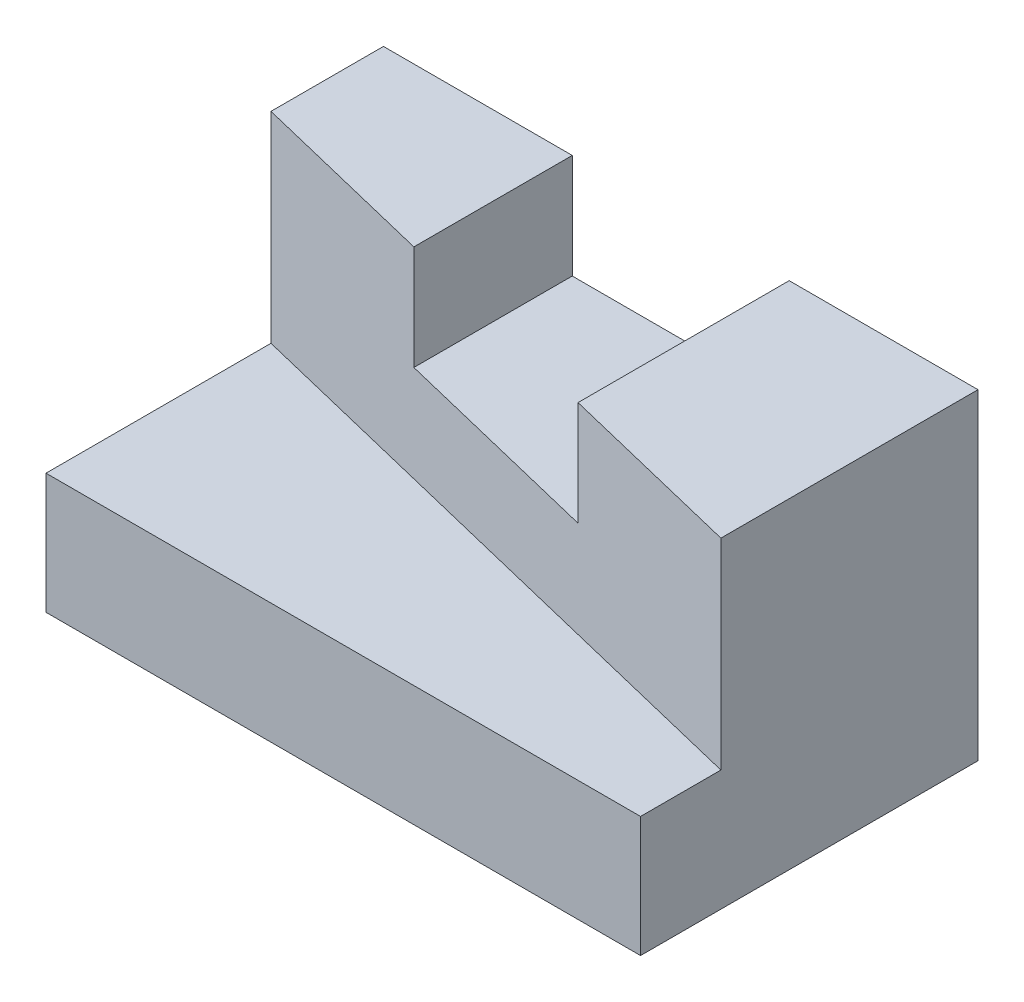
ISO-10303-21;
HEADER;
FILE_DESCRIPTION(('STEP AP214'),'2;1');
FILE_NAME('part.step','',(''),(''),'','','');
FILE_SCHEMA(('AUTOMOTIVE_DESIGN { 1 0 10303 214 1 1 1 1 }'));
ENDSEC;
DATA;
#1=APPLICATION_CONTEXT('core data for automotive mechanical design processes');
#2=APPLICATION_PROTOCOL_DEFINITION('international standard','automotive_design',2000,#1);
#3=PRODUCT_CONTEXT('',#1,'mechanical');
#4=PRODUCT('Part','Part','',(#3));
#5=PRODUCT_RELATED_PRODUCT_CATEGORY('part','',(#4));
#6=PRODUCT_DEFINITION_FORMATION('','',#4);
#7=PRODUCT_DEFINITION_CONTEXT('part definition',#1,'design');
#8=PRODUCT_DEFINITION('design','',#6,#7);
#9=PRODUCT_DEFINITION_SHAPE('','',#8);
#10=(LENGTH_UNIT() NAMED_UNIT(*) SI_UNIT(.MILLI.,.METRE.));
#11=(NAMED_UNIT(*) PLANE_ANGLE_UNIT() SI_UNIT($,.RADIAN.));
#12=(NAMED_UNIT(*) SI_UNIT($,.STERADIAN.) SOLID_ANGLE_UNIT());
#13=UNCERTAINTY_MEASURE_WITH_UNIT(LENGTH_MEASURE(1.E-05),#10,'distance_accuracy_value','');
#14=(GEOMETRIC_REPRESENTATION_CONTEXT(3) GLOBAL_UNCERTAINTY_ASSIGNED_CONTEXT((#13)) GLOBAL_UNIT_ASSIGNED_CONTEXT((#10,
#11,#12)) REPRESENTATION_CONTEXT('',''));
#15=CARTESIAN_POINT('',(0.,0.,0.));
#16=DIRECTION('',(0.,0.,1.));
#17=DIRECTION('',(1.,0.,0.));
#18=AXIS2_PLACEMENT_3D('',#15,#16,#17);
#19=CARTESIAN_POINT('',(-37.,20.,42.));
#20=DIRECTION('',(1.,0.,0.));
#21=DIRECTION('',(0.,0.,-1.));
#22=AXIS2_PLACEMENT_3D('',#19,#20,#21);
#23=PLANE('',#22);
#24=DIRECTION('',(0.,0.,1.));
#25=VECTOR('',#24,1.);
#26=CARTESIAN_POINT('',(-37.,-5.,42.));
#27=LINE('',#26,#25);
#28=CARTESIAN_POINT('',(-37.,-5.,14.));
#29=VERTEX_POINT('',#28);
#30=CARTESIAN_POINT('',(-37.,-5.,42.));
#31=VERTEX_POINT('',#30);
#32=EDGE_CURVE('E45',#29,#31,#27,.T.);
#33=ORIENTED_EDGE('',*,*,#32,.F.);
#34=DIRECTION('',(0.,1.,0.));
#35=VECTOR('',#34,1.);
#36=CARTESIAN_POINT('',(-37.,-5.,14.));
#37=LINE('',#36,#35);
#38=CARTESIAN_POINT('',(-37.,20.,14.));
#39=VERTEX_POINT('',#38);
#40=EDGE_CURVE('E93',#29,#39,#37,.T.);
#41=ORIENTED_EDGE('',*,*,#40,.T.);
#42=DIRECTION('',(0.,0.,-1.));
#43=VECTOR('',#42,1.);
#44=CARTESIAN_POINT('',(-37.,20.,42.));
#45=LINE('',#44,#43);
#46=CARTESIAN_POINT('',(-37.,20.,0.));
#47=VERTEX_POINT('',#46);
#48=EDGE_CURVE('E86',#39,#47,#45,.T.);
#49=ORIENTED_EDGE('',*,*,#48,.T.);
#50=DIRECTION('',(0.,-1.,0.));
#51=VECTOR('',#50,1.);
#52=CARTESIAN_POINT('',(-37.,20.,0.));
#53=LINE('',#52,#51);
#54=CARTESIAN_POINT('',(-37.,-20.,0.));
#55=VERTEX_POINT('',#54);
#56=EDGE_CURVE('E90',#47,#55,#53,.T.);
#57=ORIENTED_EDGE('',*,*,#56,.T.);
#58=DIRECTION('',(0.,0.,-1.));
#59=VECTOR('',#58,1.);
#60=CARTESIAN_POINT('',(-37.,-20.,42.));
#61=LINE('',#60,#59);
#62=CARTESIAN_POINT('',(-37.,-20.,42.));
#63=VERTEX_POINT('',#62);
#64=EDGE_CURVE('E11',#63,#55,#61,.T.);
#65=ORIENTED_EDGE('',*,*,#64,.F.);
#66=DIRECTION('',(0.,-1.,0.));
#67=VECTOR('',#66,1.);
#68=CARTESIAN_POINT('',(-37.,20.,42.));
#69=LINE('',#68,#67);
#70=EDGE_CURVE('E106',#31,#63,#69,.T.);
#71=ORIENTED_EDGE('',*,*,#70,.F.);
#72=EDGE_LOOP('',(#33,#41,#49,#57,#65,#71));
#73=FACE_BOUND('',#72,.T.);
#74=ADVANCED_FACE('F31',(#73),#23,.F.);
#75=CARTESIAN_POINT('',(-37.,-20.,42.));
#76=DIRECTION('',(0.,1.,0.));
#77=DIRECTION('',(0.,0.,1.));
#78=AXIS2_PLACEMENT_3D('',#75,#76,#77);
#79=PLANE('',#78);
#80=DIRECTION('',(1.,0.,0.));
#81=VECTOR('',#80,1.);
#82=CARTESIAN_POINT('',(-37.,-20.,0.));
#83=LINE('',#82,#81);
#84=CARTESIAN_POINT('',(37.,-20.,0.));
#85=VERTEX_POINT('',#84);
#86=EDGE_CURVE('E111',#55,#85,#83,.T.);
#87=ORIENTED_EDGE('',*,*,#86,.T.);
#88=DIRECTION('',(0.,0.,-1.));
#89=VECTOR('',#88,1.);
#90=CARTESIAN_POINT('',(37.,-20.,42.));
#91=LINE('',#90,#89);
#92=CARTESIAN_POINT('',(37.,-20.,42.));
#93=VERTEX_POINT('',#92);
#94=EDGE_CURVE('E38',#93,#85,#91,.T.);
#95=ORIENTED_EDGE('',*,*,#94,.F.);
#96=DIRECTION('',(1.,0.,0.));
#97=VECTOR('',#96,1.);
#98=CARTESIAN_POINT('',(-37.,-20.,42.));
#99=LINE('',#98,#97);
#100=EDGE_CURVE('E54',#63,#93,#99,.T.);
#101=ORIENTED_EDGE('',*,*,#100,.F.);
#102=ORIENTED_EDGE('',*,*,#64,.T.);
#103=EDGE_LOOP('',(#87,#95,#101,#102));
#104=FACE_BOUND('',#103,.T.);
#105=ADVANCED_FACE('F219',(#104),#79,.F.);
#106=CARTESIAN_POINT('',(37.,20.,42.));
#107=DIRECTION('',(-1.,0.,0.));
#108=DIRECTION('',(0.,0.,1.));
#109=AXIS2_PLACEMENT_3D('',#106,#107,#108);
#110=PLANE('',#109);
#111=DIRECTION('',(0.,0.,-1.));
#112=VECTOR('',#111,1.);
#113=CARTESIAN_POINT('',(37.,20.,42.));
#114=LINE('',#113,#112);
#115=CARTESIAN_POINT('',(37.,20.,32.));
#116=VERTEX_POINT('',#115);
#117=CARTESIAN_POINT('',(37.,20.,0.));
#118=VERTEX_POINT('',#117);
#119=EDGE_CURVE('E141',#116,#118,#114,.T.);
#120=ORIENTED_EDGE('',*,*,#119,.F.);
#121=DIRECTION('',(0.,1.,0.));
#122=VECTOR('',#121,1.);
#123=CARTESIAN_POINT('',(37.,-5.,32.));
#124=LINE('',#123,#122);
#125=CARTESIAN_POINT('',(37.,-5.,32.));
#126=VERTEX_POINT('',#125);
#127=EDGE_CURVE('E163',#126,#116,#124,.T.);
#128=ORIENTED_EDGE('',*,*,#127,.F.);
#129=DIRECTION('',(0.,0.,-1.));
#130=VECTOR('',#129,1.);
#131=CARTESIAN_POINT('',(37.,-5.,32.));
#132=LINE('',#131,#130);
#133=CARTESIAN_POINT('',(37.,-5.,42.));
#134=VERTEX_POINT('',#133);
#135=EDGE_CURVE('E205',#134,#126,#132,.T.);
#136=ORIENTED_EDGE('',*,*,#135,.F.);
#137=DIRECTION('',(0.,1.,0.));
#138=VECTOR('',#137,1.);
#139=CARTESIAN_POINT('',(37.,20.,42.));
#140=LINE('',#139,#138);
#141=EDGE_CURVE('E97',#93,#134,#140,.T.);
#142=ORIENTED_EDGE('',*,*,#141,.F.);
#143=ORIENTED_EDGE('',*,*,#94,.T.);
#144=DIRECTION('',(0.,1.,0.));
#145=VECTOR('',#144,1.);
#146=CARTESIAN_POINT('',(37.,20.,0.));
#147=LINE('',#146,#145);
#148=EDGE_CURVE('E114',#85,#118,#147,.T.);
#149=ORIENTED_EDGE('',*,*,#148,.T.);
#150=EDGE_LOOP('',(#120,#128,#136,#142,#143,#149));
#151=FACE_BOUND('',#150,.T.);
#152=ADVANCED_FACE('F146',(#151),#110,.F.);
#153=CARTESIAN_POINT('',(13.5,20.,42.));
#154=DIRECTION('',(0.,-1.,0.));
#155=DIRECTION('',(0.,0.,-1.));
#156=AXIS2_PLACEMENT_3D('',#153,#154,#155);
#157=PLANE('',#156);
#158=DIRECTION('',(0.,0.,-1.));
#159=VECTOR('',#158,1.);
#160=CARTESIAN_POINT('',(13.5,20.,42.));
#161=LINE('',#160,#159);
#162=CARTESIAN_POINT('',(13.5,20.,26.2837837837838));
#163=VERTEX_POINT('',#162);
#164=CARTESIAN_POINT('',(13.5,20.,0.));
#165=VERTEX_POINT('',#164);
#166=EDGE_CURVE('E139',#163,#165,#161,.T.);
#167=ORIENTED_EDGE('',*,*,#166,.F.);
#168=DIRECTION('',(-0.971667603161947,0.,-0.236351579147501));
#169=VECTOR('',#168,1.);
#170=CARTESIAN_POINT('',(-37.,20.,14.));
#171=LINE('',#170,#169);
#172=EDGE_CURVE('E159',#116,#163,#171,.T.);
#173=ORIENTED_EDGE('',*,*,#172,.F.);
#174=ORIENTED_EDGE('',*,*,#119,.T.);
#175=DIRECTION('',(-1.,0.,0.));
#176=VECTOR('',#175,1.);
#177=CARTESIAN_POINT('',(13.5,20.,0.));
#178=LINE('',#177,#176);
#179=EDGE_CURVE('E124',#118,#165,#178,.T.);
#180=ORIENTED_EDGE('',*,*,#179,.T.);
#181=EDGE_LOOP('',(#167,#173,#174,#180));
#182=FACE_BOUND('',#181,.T.);
#183=ADVANCED_FACE('F154',(#182),#157,.F.);
#184=CARTESIAN_POINT('',(13.5,20.,42.));
#185=DIRECTION('',(1.,0.,0.));
#186=DIRECTION('',(0.,0.,-1.));
#187=AXIS2_PLACEMENT_3D('',#184,#185,#186);
#188=PLANE('',#187);
#189=DIRECTION('',(0.,0.,-1.));
#190=VECTOR('',#189,1.);
#191=CARTESIAN_POINT('',(13.5,7.,42.));
#192=LINE('',#191,#190);
#193=CARTESIAN_POINT('',(13.5,7.,26.2837837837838));
#194=VERTEX_POINT('',#193);
#195=CARTESIAN_POINT('',(13.5,7.,0.));
#196=VERTEX_POINT('',#195);
#197=EDGE_CURVE('E137',#194,#196,#192,.T.);
#198=ORIENTED_EDGE('',*,*,#197,.F.);
#199=DIRECTION('',(0.,1.,0.));
#200=VECTOR('',#199,1.);
#201=CARTESIAN_POINT('',(13.5,20.,26.2837837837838));
#202=LINE('',#201,#200);
#203=EDGE_CURVE('E112',#194,#163,#202,.T.);
#204=ORIENTED_EDGE('',*,*,#203,.T.);
#205=ORIENTED_EDGE('',*,*,#166,.T.);
#206=DIRECTION('',(0.,-1.,0.));
#207=VECTOR('',#206,1.);
#208=CARTESIAN_POINT('',(13.5,20.,0.));
#209=LINE('',#208,#207);
#210=EDGE_CURVE('E127',#165,#196,#209,.T.);
#211=ORIENTED_EDGE('',*,*,#210,.T.);
#212=EDGE_LOOP('',(#198,#204,#205,#211));
#213=FACE_BOUND('',#212,.T.);
#214=ADVANCED_FACE('F191',(#213),#188,.F.);
#215=CARTESIAN_POINT('',(13.5,7.,42.));
#216=DIRECTION('',(0.,-1.,0.));
#217=DIRECTION('',(0.,0.,-1.));
#218=AXIS2_PLACEMENT_3D('',#215,#216,#217);
#219=PLANE('',#218);
#220=DIRECTION('',(0.,0.,-1.));
#221=VECTOR('',#220,1.);
#222=CARTESIAN_POINT('',(-13.5,7.,42.));
#223=LINE('',#222,#221);
#224=CARTESIAN_POINT('',(-13.5,7.,19.7162162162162));
#225=VERTEX_POINT('',#224);
#226=CARTESIAN_POINT('',(-13.5,7.,0.));
#227=VERTEX_POINT('',#226);
#228=EDGE_CURVE('E135',#225,#227,#223,.T.);
#229=ORIENTED_EDGE('',*,*,#228,.F.);
#230=DIRECTION('',(0.971667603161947,0.,0.236351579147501));
#231=VECTOR('',#230,1.);
#232=CARTESIAN_POINT('',(17.1093103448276,7.,27.161724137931));
#233=LINE('',#232,#231);
#234=EDGE_CURVE('E117',#225,#194,#233,.T.);
#235=ORIENTED_EDGE('',*,*,#234,.T.);
#236=ORIENTED_EDGE('',*,*,#197,.T.);
#237=DIRECTION('',(-1.,0.,0.));
#238=VECTOR('',#237,1.);
#239=CARTESIAN_POINT('',(13.5,7.,0.));
#240=LINE('',#239,#238);
#241=EDGE_CURVE('E130',#196,#227,#240,.T.);
#242=ORIENTED_EDGE('',*,*,#241,.T.);
#243=EDGE_LOOP('',(#229,#235,#236,#242));
#244=FACE_BOUND('',#243,.T.);
#245=ADVANCED_FACE('F188',(#244),#219,.F.);
#246=CARTESIAN_POINT('',(-13.5,7.,42.));
#247=DIRECTION('',(-1.,0.,0.));
#248=DIRECTION('',(0.,0.,1.));
#249=AXIS2_PLACEMENT_3D('',#246,#247,#248);
#250=PLANE('',#249);
#251=DIRECTION('',(0.,0.,-1.));
#252=VECTOR('',#251,1.);
#253=CARTESIAN_POINT('',(-13.5,20.,42.));
#254=LINE('',#253,#252);
#255=CARTESIAN_POINT('',(-13.5,20.,19.7162162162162));
#256=VERTEX_POINT('',#255);
#257=CARTESIAN_POINT('',(-13.5,20.,0.));
#258=VERTEX_POINT('',#257);
#259=EDGE_CURVE('E96',#256,#258,#254,.T.);
#260=ORIENTED_EDGE('',*,*,#259,.F.);
#261=DIRECTION('',(0.,-1.,0.));
#262=VECTOR('',#261,1.);
#263=CARTESIAN_POINT('',(-13.5,7.,19.7162162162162));
#264=LINE('',#263,#262);
#265=EDGE_CURVE('E189',#256,#225,#264,.T.);
#266=ORIENTED_EDGE('',*,*,#265,.T.);
#267=ORIENTED_EDGE('',*,*,#228,.T.);
#268=DIRECTION('',(0.,1.,0.));
#269=VECTOR('',#268,1.);
#270=CARTESIAN_POINT('',(-13.5,7.,0.));
#271=LINE('',#270,#269);
#272=EDGE_CURVE('E107',#227,#258,#271,.T.);
#273=ORIENTED_EDGE('',*,*,#272,.T.);
#274=EDGE_LOOP('',(#260,#266,#267,#273));
#275=FACE_BOUND('',#274,.T.);
#276=ADVANCED_FACE('F193',(#275),#250,.F.);
#277=CARTESIAN_POINT('',(-37.,20.,42.));
#278=DIRECTION('',(0.,-1.,0.));
#279=DIRECTION('',(0.,0.,-1.));
#280=AXIS2_PLACEMENT_3D('',#277,#278,#279);
#281=PLANE('',#280);
#282=ORIENTED_EDGE('',*,*,#48,.F.);
#283=EDGE_CURVE('E211',#256,#39,#171,.T.);
#284=ORIENTED_EDGE('',*,*,#283,.F.);
#285=ORIENTED_EDGE('',*,*,#259,.T.);
#286=DIRECTION('',(-1.,0.,0.));
#287=VECTOR('',#286,1.);
#288=CARTESIAN_POINT('',(-37.,20.,0.));
#289=LINE('',#288,#287);
#290=EDGE_CURVE('E100',#258,#47,#289,.T.);
#291=ORIENTED_EDGE('',*,*,#290,.T.);
#292=EDGE_LOOP('',(#282,#284,#285,#291));
#293=FACE_BOUND('',#292,.T.);
#294=ADVANCED_FACE('F101',(#293),#281,.F.);
#295=CARTESIAN_POINT('',(-37.,-20.,42.));
#296=DIRECTION('',(0.,0.,1.));
#297=DIRECTION('',(1.,0.,0.));
#298=AXIS2_PLACEMENT_3D('',#295,#296,#297);
#299=PLANE('',#298);
#300=DIRECTION('',(1.,0.,0.));
#301=VECTOR('',#300,1.);
#302=CARTESIAN_POINT('',(37.,-5.,42.));
#303=LINE('',#302,#301);
#304=EDGE_CURVE('E199',#31,#134,#303,.T.);
#305=ORIENTED_EDGE('',*,*,#304,.F.);
#306=ORIENTED_EDGE('',*,*,#70,.T.);
#307=ORIENTED_EDGE('',*,*,#100,.T.);
#308=ORIENTED_EDGE('',*,*,#141,.T.);
#309=EDGE_LOOP('',(#305,#306,#307,#308));
#310=FACE_BOUND('',#309,.T.);
#311=ADVANCED_FACE('F198',(#310),#299,.T.);
#312=CARTESIAN_POINT('',(-37.,-20.,0.));
#313=DIRECTION('',(0.,0.,1.));
#314=DIRECTION('',(1.,0.,0.));
#315=AXIS2_PLACEMENT_3D('',#312,#313,#314);
#316=PLANE('',#315);
#317=ORIENTED_EDGE('',*,*,#56,.F.);
#318=ORIENTED_EDGE('',*,*,#290,.F.);
#319=ORIENTED_EDGE('',*,*,#272,.F.);
#320=ORIENTED_EDGE('',*,*,#241,.F.);
#321=ORIENTED_EDGE('',*,*,#210,.F.);
#322=ORIENTED_EDGE('',*,*,#179,.F.);
#323=ORIENTED_EDGE('',*,*,#148,.F.);
#324=ORIENTED_EDGE('',*,*,#86,.F.);
#325=EDGE_LOOP('',(#317,#318,#319,#320,#321,#322,#323,#324));
#326=FACE_BOUND('',#325,.T.);
#327=ADVANCED_FACE('F109',(#326),#316,.F.);
#328=CARTESIAN_POINT('',(-37.,-5.,14.));
#329=DIRECTION('',(0.236351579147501,0.,-0.971667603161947));
#330=DIRECTION('',(-0.971667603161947,0.,-0.236351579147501));
#331=AXIS2_PLACEMENT_3D('',#328,#329,#330);
#332=PLANE('',#331);
#333=ORIENTED_EDGE('',*,*,#234,.F.);
#334=ORIENTED_EDGE('',*,*,#265,.F.);
#335=ORIENTED_EDGE('',*,*,#283,.T.);
#336=ORIENTED_EDGE('',*,*,#40,.F.);
#337=DIRECTION('',(-0.971667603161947,0.,-0.236351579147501));
#338=VECTOR('',#337,1.);
#339=CARTESIAN_POINT('',(-37.,-5.,14.));
#340=LINE('',#339,#338);
#341=EDGE_CURVE('E203',#126,#29,#340,.T.);
#342=ORIENTED_EDGE('',*,*,#341,.F.);
#343=ORIENTED_EDGE('',*,*,#127,.T.);
#344=ORIENTED_EDGE('',*,*,#172,.T.);
#345=ORIENTED_EDGE('',*,*,#203,.F.);
#346=EDGE_LOOP('',(#333,#334,#335,#336,#342,#343,#344,#345));
#347=FACE_BOUND('',#346,.T.);
#348=ADVANCED_FACE('F182',(#347),#332,.F.);
#349=CARTESIAN_POINT('',(37.,-5.,32.));
#350=DIRECTION('',(0.,-1.,0.));
#351=DIRECTION('',(0.,0.,-1.));
#352=AXIS2_PLACEMENT_3D('',#349,#350,#351);
#353=PLANE('',#352);
#354=ORIENTED_EDGE('',*,*,#341,.T.);
#355=ORIENTED_EDGE('',*,*,#32,.T.);
#356=ORIENTED_EDGE('',*,*,#304,.T.);
#357=ORIENTED_EDGE('',*,*,#135,.T.);
#358=EDGE_LOOP('',(#354,#355,#356,#357));
#359=FACE_BOUND('',#358,.T.);
#360=ADVANCED_FACE('F206',(#359),#353,.F.);
#361=CLOSED_SHELL('',(#74,#105,#152,#183,#214,#245,#276,#294,#311,#327,#348,#360));
#362=MANIFOLD_SOLID_BREP('B2',#361);
#363=ADVANCED_BREP_SHAPE_REPRESENTATION('',(#18,#362),#14);
#364=SHAPE_DEFINITION_REPRESENTATION(#9,#363);
ENDSEC;
END-ISO-10303-21;
